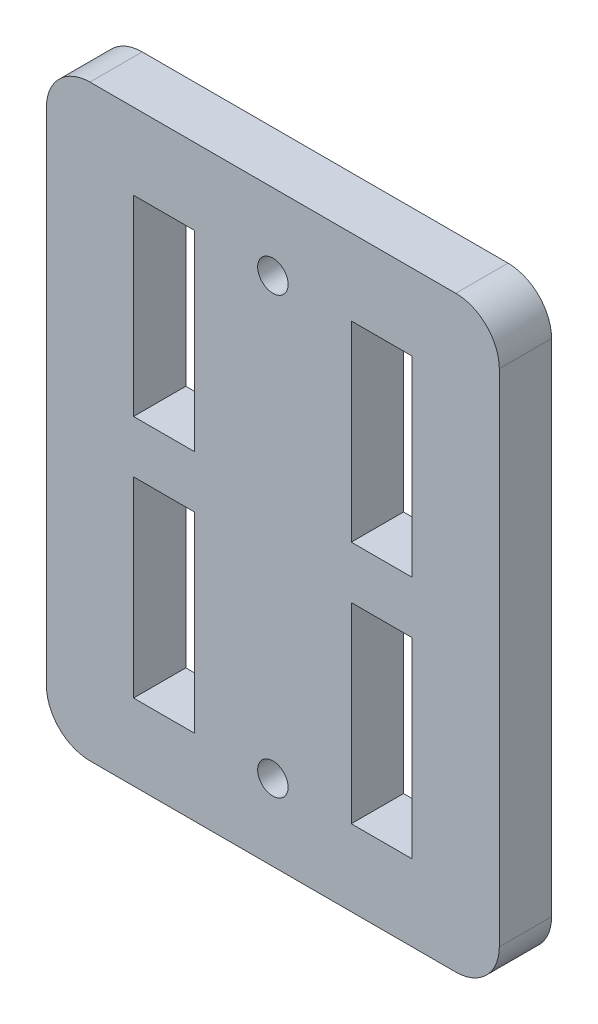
ISO-10303-21;
HEADER;
FILE_DESCRIPTION(('STEP AP214'),'2;1');
FILE_NAME('part.step','',(''),(''),'','','');
FILE_SCHEMA(('AUTOMOTIVE_DESIGN { 1 0 10303 214 1 1 1 1 }'));
ENDSEC;
DATA;
#1=APPLICATION_CONTEXT('core data for automotive mechanical design processes');
#2=APPLICATION_PROTOCOL_DEFINITION('international standard','automotive_design',2000,#1);
#3=PRODUCT_CONTEXT('',#1,'mechanical');
#4=PRODUCT('Part','Part','',(#3));
#5=PRODUCT_RELATED_PRODUCT_CATEGORY('part','',(#4));
#6=PRODUCT_DEFINITION_FORMATION('','',#4);
#7=PRODUCT_DEFINITION_CONTEXT('part definition',#1,'design');
#8=PRODUCT_DEFINITION('design','',#6,#7);
#9=PRODUCT_DEFINITION_SHAPE('','',#8);
#10=(LENGTH_UNIT() NAMED_UNIT(*) SI_UNIT(.MILLI.,.METRE.));
#11=(NAMED_UNIT(*) PLANE_ANGLE_UNIT() SI_UNIT($,.RADIAN.));
#12=(NAMED_UNIT(*) SI_UNIT($,.STERADIAN.) SOLID_ANGLE_UNIT());
#13=UNCERTAINTY_MEASURE_WITH_UNIT(LENGTH_MEASURE(1.E-05),#10,'distance_accuracy_value','');
#14=(GEOMETRIC_REPRESENTATION_CONTEXT(3) GLOBAL_UNCERTAINTY_ASSIGNED_CONTEXT((#13)) GLOBAL_UNIT_ASSIGNED_CONTEXT((#10,
#11,#12)) REPRESENTATION_CONTEXT('',''));
#15=CARTESIAN_POINT('',(0.,0.,0.));
#16=DIRECTION('',(0.,0.,1.));
#17=DIRECTION('',(1.,0.,0.));
#18=AXIS2_PLACEMENT_3D('',#15,#16,#17);
#19=CARTESIAN_POINT('',(21.,-28.75,3.));
#20=DIRECTION('',(0.,0.,-1.));
#21=DIRECTION('',(-1.,0.,0.));
#22=AXIS2_PLACEMENT_3D('',#19,#20,#21);
#23=CYLINDRICAL_SURFACE('',#22,5.);
#24=CARTESIAN_POINT('',(21.,-28.75,-3.));
#25=DIRECTION('',(0.,0.,-1.));
#26=DIRECTION('',(-1.,0.,0.));
#27=AXIS2_PLACEMENT_3D('',#24,#25,#26);
#28=CIRCLE('',#27,5.);
#29=CARTESIAN_POINT('',(26.,-28.75,-3.));
#30=VERTEX_POINT('',#29);
#31=CARTESIAN_POINT('',(21.,-33.75,-3.));
#32=VERTEX_POINT('',#31);
#33=EDGE_CURVE('E325',#30,#32,#28,.T.);
#34=ORIENTED_EDGE('',*,*,#33,.F.);
#35=DIRECTION('',(0.,0.,-1.));
#36=VECTOR('',#35,1.);
#37=CARTESIAN_POINT('',(26.,-28.75,3.));
#38=LINE('',#37,#36);
#39=CARTESIAN_POINT('',(26.,-28.75,3.));
#40=VERTEX_POINT('',#39);
#41=EDGE_CURVE('E11',#40,#30,#38,.T.);
#42=ORIENTED_EDGE('',*,*,#41,.F.);
#43=CARTESIAN_POINT('',(21.,-28.75,3.));
#44=DIRECTION('',(0.,0.,-1.));
#45=DIRECTION('',(-1.,0.,0.));
#46=AXIS2_PLACEMENT_3D('',#43,#44,#45);
#47=CIRCLE('',#46,5.);
#48=CARTESIAN_POINT('',(21.,-33.75,3.));
#49=VERTEX_POINT('',#48);
#50=EDGE_CURVE('E332',#40,#49,#47,.T.);
#51=ORIENTED_EDGE('',*,*,#50,.T.);
#52=DIRECTION('',(0.,0.,-1.));
#53=VECTOR('',#52,1.);
#54=CARTESIAN_POINT('',(21.,-33.75,3.));
#55=LINE('',#54,#53);
#56=EDGE_CURVE('E37',#49,#32,#55,.T.);
#57=ORIENTED_EDGE('',*,*,#56,.T.);
#58=EDGE_LOOP('',(#34,#42,#51,#57));
#59=FACE_BOUND('',#58,.T.);
#60=ADVANCED_FACE('F34',(#59),#23,.T.);
#61=CARTESIAN_POINT('',(26.,28.75,3.));
#62=DIRECTION('',(1.,0.,0.));
#63=DIRECTION('',(0.,0.,-1.));
#64=AXIS2_PLACEMENT_3D('',#61,#62,#63);
#65=PLANE('',#64);
#66=DIRECTION('',(0.,-1.,0.));
#67=VECTOR('',#66,1.);
#68=CARTESIAN_POINT('',(26.,28.75,-3.));
#69=LINE('',#68,#67);
#70=CARTESIAN_POINT('',(26.,28.75,-3.));
#71=VERTEX_POINT('',#70);
#72=EDGE_CURVE('E336',#71,#30,#69,.T.);
#73=ORIENTED_EDGE('',*,*,#72,.F.);
#74=DIRECTION('',(0.,0.,-1.));
#75=VECTOR('',#74,1.);
#76=CARTESIAN_POINT('',(26.,28.75,3.));
#77=LINE('',#76,#75);
#78=CARTESIAN_POINT('',(26.,28.75,3.));
#79=VERTEX_POINT('',#78);
#80=EDGE_CURVE('E42',#79,#71,#77,.T.);
#81=ORIENTED_EDGE('',*,*,#80,.F.);
#82=DIRECTION('',(0.,-1.,0.));
#83=VECTOR('',#82,1.);
#84=CARTESIAN_POINT('',(26.,28.75,3.));
#85=LINE('',#84,#83);
#86=EDGE_CURVE('E354',#79,#40,#85,.T.);
#87=ORIENTED_EDGE('',*,*,#86,.T.);
#88=ORIENTED_EDGE('',*,*,#41,.T.);
#89=EDGE_LOOP('',(#73,#81,#87,#88));
#90=FACE_BOUND('',#89,.T.);
#91=ADVANCED_FACE('F401',(#90),#65,.T.);
#92=CARTESIAN_POINT('',(21.,28.75,3.));
#93=DIRECTION('',(0.,0.,-1.));
#94=DIRECTION('',(-1.,0.,0.));
#95=AXIS2_PLACEMENT_3D('',#92,#93,#94);
#96=CYLINDRICAL_SURFACE('',#95,5.);
#97=CARTESIAN_POINT('',(21.,28.75,-3.));
#98=DIRECTION('',(0.,0.,-1.));
#99=DIRECTION('',(-1.,0.,0.));
#100=AXIS2_PLACEMENT_3D('',#97,#98,#99);
#101=CIRCLE('',#100,5.);
#102=CARTESIAN_POINT('',(21.,33.75,-3.));
#103=VERTEX_POINT('',#102);
#104=EDGE_CURVE('E374',#103,#71,#101,.T.);
#105=ORIENTED_EDGE('',*,*,#104,.F.);
#106=DIRECTION('',(0.,0.,-1.));
#107=VECTOR('',#106,1.);
#108=CARTESIAN_POINT('',(21.,33.75,3.));
#109=LINE('',#108,#107);
#110=CARTESIAN_POINT('',(21.,33.75,3.));
#111=VERTEX_POINT('',#110);
#112=EDGE_CURVE('E380',#111,#103,#109,.T.);
#113=ORIENTED_EDGE('',*,*,#112,.F.);
#114=CARTESIAN_POINT('',(21.,28.75,3.));
#115=DIRECTION('',(0.,0.,-1.));
#116=DIRECTION('',(-1.,0.,0.));
#117=AXIS2_PLACEMENT_3D('',#114,#115,#116);
#118=CIRCLE('',#117,5.);
#119=EDGE_CURVE('E351',#111,#79,#118,.T.);
#120=ORIENTED_EDGE('',*,*,#119,.T.);
#121=ORIENTED_EDGE('',*,*,#80,.T.);
#122=EDGE_LOOP('',(#105,#113,#120,#121));
#123=FACE_BOUND('',#122,.T.);
#124=ADVANCED_FACE('F421',(#123),#96,.T.);
#125=CARTESIAN_POINT('',(-21.,33.75,3.));
#126=DIRECTION('',(0.,1.,0.));
#127=DIRECTION('',(0.,0.,1.));
#128=AXIS2_PLACEMENT_3D('',#125,#126,#127);
#129=PLANE('',#128);
#130=DIRECTION('',(1.,0.,0.));
#131=VECTOR('',#130,1.);
#132=CARTESIAN_POINT('',(-21.,33.75,-3.));
#133=LINE('',#132,#131);
#134=CARTESIAN_POINT('',(-21.,33.75,-3.));
#135=VERTEX_POINT('',#134);
#136=EDGE_CURVE('E371',#135,#103,#133,.T.);
#137=ORIENTED_EDGE('',*,*,#136,.F.);
#138=DIRECTION('',(0.,0.,-1.));
#139=VECTOR('',#138,1.);
#140=CARTESIAN_POINT('',(-21.,33.75,3.));
#141=LINE('',#140,#139);
#142=CARTESIAN_POINT('',(-21.,33.75,3.));
#143=VERTEX_POINT('',#142);
#144=EDGE_CURVE('E382',#143,#135,#141,.T.);
#145=ORIENTED_EDGE('',*,*,#144,.F.);
#146=DIRECTION('',(1.,0.,0.));
#147=VECTOR('',#146,1.);
#148=CARTESIAN_POINT('',(-21.,33.75,3.));
#149=LINE('',#148,#147);
#150=EDGE_CURVE('E348',#143,#111,#149,.T.);
#151=ORIENTED_EDGE('',*,*,#150,.T.);
#152=ORIENTED_EDGE('',*,*,#112,.T.);
#153=EDGE_LOOP('',(#137,#145,#151,#152));
#154=FACE_BOUND('',#153,.T.);
#155=ADVANCED_FACE('F419',(#154),#129,.T.);
#156=CARTESIAN_POINT('',(-21.,28.75,3.));
#157=DIRECTION('',(0.,0.,-1.));
#158=DIRECTION('',(-1.,0.,0.));
#159=AXIS2_PLACEMENT_3D('',#156,#157,#158);
#160=CYLINDRICAL_SURFACE('',#159,5.);
#161=CARTESIAN_POINT('',(-21.,28.75,-3.));
#162=DIRECTION('',(0.,0.,-1.));
#163=DIRECTION('',(-1.,0.,0.));
#164=AXIS2_PLACEMENT_3D('',#161,#162,#163);
#165=CIRCLE('',#164,5.);
#166=CARTESIAN_POINT('',(-26.,28.75,-3.));
#167=VERTEX_POINT('',#166);
#168=EDGE_CURVE('E368',#167,#135,#165,.T.);
#169=ORIENTED_EDGE('',*,*,#168,.F.);
#170=DIRECTION('',(0.,0.,-1.));
#171=VECTOR('',#170,1.);
#172=CARTESIAN_POINT('',(-26.,28.75,3.));
#173=LINE('',#172,#171);
#174=CARTESIAN_POINT('',(-26.,28.75,3.));
#175=VERTEX_POINT('',#174);
#176=EDGE_CURVE('E384',#175,#167,#173,.T.);
#177=ORIENTED_EDGE('',*,*,#176,.F.);
#178=CARTESIAN_POINT('',(-21.,28.75,3.));
#179=DIRECTION('',(0.,0.,-1.));
#180=DIRECTION('',(-1.,0.,0.));
#181=AXIS2_PLACEMENT_3D('',#178,#179,#180);
#182=CIRCLE('',#181,5.);
#183=EDGE_CURVE('E345',#175,#143,#182,.T.);
#184=ORIENTED_EDGE('',*,*,#183,.T.);
#185=ORIENTED_EDGE('',*,*,#144,.T.);
#186=EDGE_LOOP('',(#169,#177,#184,#185));
#187=FACE_BOUND('',#186,.T.);
#188=ADVANCED_FACE('F415',(#187),#160,.T.);
#189=CARTESIAN_POINT('',(-26.,-28.75,3.));
#190=DIRECTION('',(-1.,0.,0.));
#191=DIRECTION('',(0.,0.,1.));
#192=AXIS2_PLACEMENT_3D('',#189,#190,#191);
#193=PLANE('',#192);
#194=DIRECTION('',(0.,1.,0.));
#195=VECTOR('',#194,1.);
#196=CARTESIAN_POINT('',(-26.,-28.75,-3.));
#197=LINE('',#196,#195);
#198=CARTESIAN_POINT('',(-26.,-28.75,-3.));
#199=VERTEX_POINT('',#198);
#200=EDGE_CURVE('E365',#199,#167,#197,.T.);
#201=ORIENTED_EDGE('',*,*,#200,.F.);
#202=DIRECTION('',(0.,0.,-1.));
#203=VECTOR('',#202,1.);
#204=CARTESIAN_POINT('',(-26.,-28.75,3.));
#205=LINE('',#204,#203);
#206=CARTESIAN_POINT('',(-26.,-28.75,3.));
#207=VERTEX_POINT('',#206);
#208=EDGE_CURVE('E386',#207,#199,#205,.T.);
#209=ORIENTED_EDGE('',*,*,#208,.F.);
#210=DIRECTION('',(0.,1.,0.));
#211=VECTOR('',#210,1.);
#212=CARTESIAN_POINT('',(-26.,-28.75,3.));
#213=LINE('',#212,#211);
#214=EDGE_CURVE('E342',#207,#175,#213,.T.);
#215=ORIENTED_EDGE('',*,*,#214,.T.);
#216=ORIENTED_EDGE('',*,*,#176,.T.);
#217=EDGE_LOOP('',(#201,#209,#215,#216));
#218=FACE_BOUND('',#217,.T.);
#219=ADVANCED_FACE('F413',(#218),#193,.T.);
#220=CARTESIAN_POINT('',(-21.,-28.75,3.));
#221=DIRECTION('',(0.,0.,-1.));
#222=DIRECTION('',(-1.,0.,0.));
#223=AXIS2_PLACEMENT_3D('',#220,#221,#222);
#224=CYLINDRICAL_SURFACE('',#223,5.);
#225=CARTESIAN_POINT('',(-21.,-28.75,-3.));
#226=DIRECTION('',(0.,0.,-1.));
#227=DIRECTION('',(-1.,0.,0.));
#228=AXIS2_PLACEMENT_3D('',#225,#226,#227);
#229=CIRCLE('',#228,5.);
#230=CARTESIAN_POINT('',(-21.,-33.75,-3.));
#231=VERTEX_POINT('',#230);
#232=EDGE_CURVE('E362',#231,#199,#229,.T.);
#233=ORIENTED_EDGE('',*,*,#232,.F.);
#234=DIRECTION('',(0.,0.,-1.));
#235=VECTOR('',#234,1.);
#236=CARTESIAN_POINT('',(-21.,-33.75,3.));
#237=LINE('',#236,#235);
#238=CARTESIAN_POINT('',(-21.,-33.75,3.));
#239=VERTEX_POINT('',#238);
#240=EDGE_CURVE('E387',#239,#231,#237,.T.);
#241=ORIENTED_EDGE('',*,*,#240,.F.);
#242=CARTESIAN_POINT('',(-21.,-28.75,3.));
#243=DIRECTION('',(0.,0.,-1.));
#244=DIRECTION('',(-1.,0.,0.));
#245=AXIS2_PLACEMENT_3D('',#242,#243,#244);
#246=CIRCLE('',#245,5.);
#247=EDGE_CURVE('E339',#239,#207,#246,.T.);
#248=ORIENTED_EDGE('',*,*,#247,.T.);
#249=ORIENTED_EDGE('',*,*,#208,.T.);
#250=EDGE_LOOP('',(#233,#241,#248,#249));
#251=FACE_BOUND('',#250,.T.);
#252=ADVANCED_FACE('F409',(#251),#224,.T.);
#253=CARTESIAN_POINT('',(21.,-33.75,3.));
#254=DIRECTION('',(0.,-1.,0.));
#255=DIRECTION('',(0.,0.,-1.));
#256=AXIS2_PLACEMENT_3D('',#253,#254,#255);
#257=PLANE('',#256);
#258=DIRECTION('',(-1.,0.,0.));
#259=VECTOR('',#258,1.);
#260=CARTESIAN_POINT('',(21.,-33.75,-3.));
#261=LINE('',#260,#259);
#262=EDGE_CURVE('E359',#32,#231,#261,.T.);
#263=ORIENTED_EDGE('',*,*,#262,.F.);
#264=ORIENTED_EDGE('',*,*,#56,.F.);
#265=DIRECTION('',(-1.,0.,0.));
#266=VECTOR('',#265,1.);
#267=CARTESIAN_POINT('',(21.,-33.75,3.));
#268=LINE('',#267,#266);
#269=EDGE_CURVE('E335',#49,#239,#268,.T.);
#270=ORIENTED_EDGE('',*,*,#269,.T.);
#271=ORIENTED_EDGE('',*,*,#240,.T.);
#272=EDGE_LOOP('',(#263,#264,#270,#271));
#273=FACE_BOUND('',#272,.T.);
#274=ADVANCED_FACE('F395',(#273),#257,.T.);
#275=CARTESIAN_POINT('',(21.,-28.75,3.));
#276=DIRECTION('',(0.,0.,-1.));
#277=DIRECTION('',(-1.,0.,0.));
#278=AXIS2_PLACEMENT_3D('',#275,#276,#277);
#279=PLANE('',#278);
#280=CARTESIAN_POINT('',(0.,-25.,3.));
#281=DIRECTION('',(0.,0.,-1.));
#282=DIRECTION('',(1.,0.,0.));
#283=AXIS2_PLACEMENT_3D('',#280,#281,#282);
#284=CIRCLE('',#283,1.75);
#285=CARTESIAN_POINT('',(1.75000000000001,-25.,3.));
#286=VERTEX_POINT('',#285);
#287=EDGE_CURVE('E678',#286,#286,#284,.T.);
#288=ORIENTED_EDGE('',*,*,#287,.T.);
#289=EDGE_LOOP('',(#288));
#290=FACE_BOUND('',#289,.T.);
#291=CARTESIAN_POINT('',(0.,25.,3.));
#292=DIRECTION('',(0.,0.,-1.));
#293=DIRECTION('',(1.,0.,0.));
#294=AXIS2_PLACEMENT_3D('',#291,#292,#293);
#295=CIRCLE('',#294,1.75);
#296=CARTESIAN_POINT('',(1.75000000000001,25.,3.));
#297=VERTEX_POINT('',#296);
#298=EDGE_CURVE('E226',#297,#297,#295,.T.);
#299=ORIENTED_EDGE('',*,*,#298,.T.);
#300=EDGE_LOOP('',(#299));
#301=FACE_BOUND('',#300,.T.);
#302=DIRECTION('',(1.,0.,0.));
#303=VECTOR('',#302,1.);
#304=CARTESIAN_POINT('',(-9.,-3.,3.));
#305=LINE('',#304,#303);
#306=CARTESIAN_POINT('',(-16.,-3.,3.));
#307=VERTEX_POINT('',#306);
#308=CARTESIAN_POINT('',(-9.,-3.,3.));
#309=VERTEX_POINT('',#308);
#310=EDGE_CURVE('E203',#307,#309,#305,.T.);
#311=ORIENTED_EDGE('',*,*,#310,.T.);
#312=DIRECTION('',(0.,-1.,0.));
#313=VECTOR('',#312,1.);
#314=CARTESIAN_POINT('',(-9.,-25.,3.));
#315=LINE('',#314,#313);
#316=CARTESIAN_POINT('',(-9.,-25.,3.));
#317=VERTEX_POINT('',#316);
#318=EDGE_CURVE('E197',#309,#317,#315,.T.);
#319=ORIENTED_EDGE('',*,*,#318,.T.);
#320=DIRECTION('',(-1.,0.,0.));
#321=VECTOR('',#320,1.);
#322=CARTESIAN_POINT('',(-16.,-25.,3.));
#323=LINE('',#322,#321);
#324=CARTESIAN_POINT('',(-16.,-25.,3.));
#325=VERTEX_POINT('',#324);
#326=EDGE_CURVE('E206',#317,#325,#323,.T.);
#327=ORIENTED_EDGE('',*,*,#326,.T.);
#328=DIRECTION('',(0.,1.,0.));
#329=VECTOR('',#328,1.);
#330=CARTESIAN_POINT('',(-16.,-3.,3.));
#331=LINE('',#330,#329);
#332=EDGE_CURVE('E50',#325,#307,#331,.T.);
#333=ORIENTED_EDGE('',*,*,#332,.T.);
#334=EDGE_LOOP('',(#311,#319,#327,#333));
#335=FACE_BOUND('',#334,.T.);
#336=DIRECTION('',(0.,1.,0.));
#337=VECTOR('',#336,1.);
#338=CARTESIAN_POINT('',(9.,-3.,3.));
#339=LINE('',#338,#337);
#340=CARTESIAN_POINT('',(9.,-25.,3.));
#341=VERTEX_POINT('',#340);
#342=CARTESIAN_POINT('',(9.,-3.,3.));
#343=VERTEX_POINT('',#342);
#344=EDGE_CURVE('E246',#341,#343,#339,.T.);
#345=ORIENTED_EDGE('',*,*,#344,.T.);
#346=DIRECTION('',(1.,0.,0.));
#347=VECTOR('',#346,1.);
#348=CARTESIAN_POINT('',(16.,-3.,3.));
#349=LINE('',#348,#347);
#350=CARTESIAN_POINT('',(16.,-3.,3.));
#351=VERTEX_POINT('',#350);
#352=EDGE_CURVE('E236',#343,#351,#349,.T.);
#353=ORIENTED_EDGE('',*,*,#352,.T.);
#354=DIRECTION('',(0.,-1.,0.));
#355=VECTOR('',#354,1.);
#356=CARTESIAN_POINT('',(16.,-25.,3.));
#357=LINE('',#356,#355);
#358=CARTESIAN_POINT('',(16.,-25.,3.));
#359=VERTEX_POINT('',#358);
#360=EDGE_CURVE('E239',#351,#359,#357,.T.);
#361=ORIENTED_EDGE('',*,*,#360,.T.);
#362=DIRECTION('',(-1.,0.,0.));
#363=VECTOR('',#362,1.);
#364=CARTESIAN_POINT('',(9.,-25.,3.));
#365=LINE('',#364,#363);
#366=EDGE_CURVE('E243',#359,#341,#365,.T.);
#367=ORIENTED_EDGE('',*,*,#366,.T.);
#368=EDGE_LOOP('',(#345,#353,#361,#367));
#369=FACE_BOUND('',#368,.T.);
#370=DIRECTION('',(-1.,0.,0.));
#371=VECTOR('',#370,1.);
#372=CARTESIAN_POINT('',(9.,3.,3.));
#373=LINE('',#372,#371);
#374=CARTESIAN_POINT('',(16.,3.,3.));
#375=VERTEX_POINT('',#374);
#376=CARTESIAN_POINT('',(9.,3.,3.));
#377=VERTEX_POINT('',#376);
#378=EDGE_CURVE('E278',#375,#377,#373,.T.);
#379=ORIENTED_EDGE('',*,*,#378,.T.);
#380=DIRECTION('',(0.,1.,0.));
#381=VECTOR('',#380,1.);
#382=CARTESIAN_POINT('',(9.,25.,3.));
#383=LINE('',#382,#381);
#384=CARTESIAN_POINT('',(9.,25.,3.));
#385=VERTEX_POINT('',#384);
#386=EDGE_CURVE('E268',#377,#385,#383,.T.);
#387=ORIENTED_EDGE('',*,*,#386,.T.);
#388=DIRECTION('',(1.,0.,0.));
#389=VECTOR('',#388,1.);
#390=CARTESIAN_POINT('',(16.,25.,3.));
#391=LINE('',#390,#389);
#392=CARTESIAN_POINT('',(16.,25.,3.));
#393=VERTEX_POINT('',#392);
#394=EDGE_CURVE('E271',#385,#393,#391,.T.);
#395=ORIENTED_EDGE('',*,*,#394,.T.);
#396=DIRECTION('',(0.,-1.,0.));
#397=VECTOR('',#396,1.);
#398=CARTESIAN_POINT('',(16.,3.,3.));
#399=LINE('',#398,#397);
#400=EDGE_CURVE('E275',#393,#375,#399,.T.);
#401=ORIENTED_EDGE('',*,*,#400,.T.);
#402=EDGE_LOOP('',(#379,#387,#395,#401));
#403=FACE_BOUND('',#402,.T.);
#404=DIRECTION('',(0.,-1.,0.));
#405=VECTOR('',#404,1.);
#406=CARTESIAN_POINT('',(-9.,3.,3.));
#407=LINE('',#406,#405);
#408=CARTESIAN_POINT('',(-9.,25.,3.));
#409=VERTEX_POINT('',#408);
#410=CARTESIAN_POINT('',(-9.,3.,3.));
#411=VERTEX_POINT('',#410);
#412=EDGE_CURVE('E310',#409,#411,#407,.T.);
#413=ORIENTED_EDGE('',*,*,#412,.T.);
#414=DIRECTION('',(-1.,0.,0.));
#415=VECTOR('',#414,1.);
#416=CARTESIAN_POINT('',(-16.,3.,3.));
#417=LINE('',#416,#415);
#418=CARTESIAN_POINT('',(-16.,3.,3.));
#419=VERTEX_POINT('',#418);
#420=EDGE_CURVE('E300',#411,#419,#417,.T.);
#421=ORIENTED_EDGE('',*,*,#420,.T.);
#422=DIRECTION('',(0.,1.,0.));
#423=VECTOR('',#422,1.);
#424=CARTESIAN_POINT('',(-16.,25.,3.));
#425=LINE('',#424,#423);
#426=CARTESIAN_POINT('',(-16.,25.,3.));
#427=VERTEX_POINT('',#426);
#428=EDGE_CURVE('E303',#419,#427,#425,.T.);
#429=ORIENTED_EDGE('',*,*,#428,.T.);
#430=DIRECTION('',(1.,0.,0.));
#431=VECTOR('',#430,1.);
#432=CARTESIAN_POINT('',(-9.,25.,3.));
#433=LINE('',#432,#431);
#434=EDGE_CURVE('E307',#427,#409,#433,.T.);
#435=ORIENTED_EDGE('',*,*,#434,.T.);
#436=EDGE_LOOP('',(#413,#421,#429,#435));
#437=FACE_BOUND('',#436,.T.);
#438=ORIENTED_EDGE('',*,*,#50,.F.);
#439=ORIENTED_EDGE('',*,*,#86,.F.);
#440=ORIENTED_EDGE('',*,*,#119,.F.);
#441=ORIENTED_EDGE('',*,*,#150,.F.);
#442=ORIENTED_EDGE('',*,*,#183,.F.);
#443=ORIENTED_EDGE('',*,*,#214,.F.);
#444=ORIENTED_EDGE('',*,*,#247,.F.);
#445=ORIENTED_EDGE('',*,*,#269,.F.);
#446=EDGE_LOOP('',(#438,#439,#440,#441,#442,#443,#444,#445));
#447=FACE_BOUND('',#446,.T.);
#448=ADVANCED_FACE('F210',(#290,#301,#335,#369,#403,#437,#447),#279,.F.);
#449=CARTESIAN_POINT('',(21.,-28.75,-3.));
#450=DIRECTION('',(0.,0.,-1.));
#451=DIRECTION('',(-1.,0.,0.));
#452=AXIS2_PLACEMENT_3D('',#449,#450,#451);
#453=PLANE('',#452);
#454=CARTESIAN_POINT('',(0.,-25.,-3.));
#455=DIRECTION('',(0.,0.,-1.));
#456=DIRECTION('',(1.,0.,0.));
#457=AXIS2_PLACEMENT_3D('',#454,#455,#456);
#458=CIRCLE('',#457,1.75);
#459=CARTESIAN_POINT('',(1.75000000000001,-25.,-3.));
#460=VERTEX_POINT('',#459);
#461=EDGE_CURVE('E681',#460,#460,#458,.T.);
#462=ORIENTED_EDGE('',*,*,#461,.F.);
#463=EDGE_LOOP('',(#462));
#464=FACE_BOUND('',#463,.T.);
#465=CARTESIAN_POINT('',(0.,25.,-3.));
#466=DIRECTION('',(0.,0.,-1.));
#467=DIRECTION('',(1.,0.,0.));
#468=AXIS2_PLACEMENT_3D('',#465,#466,#467);
#469=CIRCLE('',#468,1.75);
#470=CARTESIAN_POINT('',(1.75000000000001,25.,-3.));
#471=VERTEX_POINT('',#470);
#472=EDGE_CURVE('E219',#471,#471,#469,.T.);
#473=ORIENTED_EDGE('',*,*,#472,.F.);
#474=EDGE_LOOP('',(#473));
#475=FACE_BOUND('',#474,.T.);
#476=DIRECTION('',(0.,-1.,0.));
#477=VECTOR('',#476,1.);
#478=CARTESIAN_POINT('',(-9.,-25.,-3.));
#479=LINE('',#478,#477);
#480=CARTESIAN_POINT('',(-9.,-3.,-3.));
#481=VERTEX_POINT('',#480);
#482=CARTESIAN_POINT('',(-9.00000000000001,-25.,-3.));
#483=VERTEX_POINT('',#482);
#484=EDGE_CURVE('E58',#481,#483,#479,.T.);
#485=ORIENTED_EDGE('',*,*,#484,.F.);
#486=DIRECTION('',(1.,0.,0.));
#487=VECTOR('',#486,1.);
#488=CARTESIAN_POINT('',(-9.,-3.,-3.));
#489=LINE('',#488,#487);
#490=CARTESIAN_POINT('',(-16.,-3.,-3.));
#491=VERTEX_POINT('',#490);
#492=EDGE_CURVE('E213',#491,#481,#489,.T.);
#493=ORIENTED_EDGE('',*,*,#492,.F.);
#494=DIRECTION('',(0.,1.,0.));
#495=VECTOR('',#494,1.);
#496=CARTESIAN_POINT('',(-16.,-3.,-3.));
#497=LINE('',#496,#495);
#498=CARTESIAN_POINT('',(-16.,-25.,-3.));
#499=VERTEX_POINT('',#498);
#500=EDGE_CURVE('E216',#499,#491,#497,.T.);
#501=ORIENTED_EDGE('',*,*,#500,.F.);
#502=DIRECTION('',(-1.,0.,0.));
#503=VECTOR('',#502,1.);
#504=CARTESIAN_POINT('',(-16.,-25.,-3.));
#505=LINE('',#504,#503);
#506=EDGE_CURVE('E225',#483,#499,#505,.T.);
#507=ORIENTED_EDGE('',*,*,#506,.F.);
#508=EDGE_LOOP('',(#485,#493,#501,#507));
#509=FACE_BOUND('',#508,.T.);
#510=DIRECTION('',(1.,0.,0.));
#511=VECTOR('',#510,1.);
#512=CARTESIAN_POINT('',(16.,-3.,-3.));
#513=LINE('',#512,#511);
#514=CARTESIAN_POINT('',(9.,-3.,-3.));
#515=VERTEX_POINT('',#514);
#516=CARTESIAN_POINT('',(16.,-3.,-3.));
#517=VERTEX_POINT('',#516);
#518=EDGE_CURVE('E232',#515,#517,#513,.T.);
#519=ORIENTED_EDGE('',*,*,#518,.F.);
#520=DIRECTION('',(0.,1.,0.));
#521=VECTOR('',#520,1.);
#522=CARTESIAN_POINT('',(9.,-3.,-3.));
#523=LINE('',#522,#521);
#524=CARTESIAN_POINT('',(9.,-25.,-3.));
#525=VERTEX_POINT('',#524);
#526=EDGE_CURVE('E240',#525,#515,#523,.T.);
#527=ORIENTED_EDGE('',*,*,#526,.F.);
#528=DIRECTION('',(-1.,0.,0.));
#529=VECTOR('',#528,1.);
#530=CARTESIAN_POINT('',(9.,-25.,-3.));
#531=LINE('',#530,#529);
#532=CARTESIAN_POINT('',(16.,-25.,-3.));
#533=VERTEX_POINT('',#532);
#534=EDGE_CURVE('E254',#533,#525,#531,.T.);
#535=ORIENTED_EDGE('',*,*,#534,.F.);
#536=DIRECTION('',(0.,-1.,0.));
#537=VECTOR('',#536,1.);
#538=CARTESIAN_POINT('',(16.,-25.,-3.));
#539=LINE('',#538,#537);
#540=EDGE_CURVE('E251',#517,#533,#539,.T.);
#541=ORIENTED_EDGE('',*,*,#540,.F.);
#542=EDGE_LOOP('',(#519,#527,#535,#541));
#543=FACE_BOUND('',#542,.T.);
#544=DIRECTION('',(0.,1.,0.));
#545=VECTOR('',#544,1.);
#546=CARTESIAN_POINT('',(9.,25.,-3.));
#547=LINE('',#546,#545);
#548=CARTESIAN_POINT('',(9.,3.,-3.));
#549=VERTEX_POINT('',#548);
#550=CARTESIAN_POINT('',(9.,25.,-3.));
#551=VERTEX_POINT('',#550);
#552=EDGE_CURVE('E261',#549,#551,#547,.T.);
#553=ORIENTED_EDGE('',*,*,#552,.F.);
#554=DIRECTION('',(-1.,0.,0.));
#555=VECTOR('',#554,1.);
#556=CARTESIAN_POINT('',(9.,3.,-3.));
#557=LINE('',#556,#555);
#558=CARTESIAN_POINT('',(16.,3.,-3.));
#559=VERTEX_POINT('',#558);
#560=EDGE_CURVE('E272',#559,#549,#557,.T.);
#561=ORIENTED_EDGE('',*,*,#560,.F.);
#562=DIRECTION('',(0.,-1.,0.));
#563=VECTOR('',#562,1.);
#564=CARTESIAN_POINT('',(16.,3.,-3.));
#565=LINE('',#564,#563);
#566=CARTESIAN_POINT('',(16.,25.,-3.));
#567=VERTEX_POINT('',#566);
#568=EDGE_CURVE('E286',#567,#559,#565,.T.);
#569=ORIENTED_EDGE('',*,*,#568,.F.);
#570=DIRECTION('',(1.,0.,0.));
#571=VECTOR('',#570,1.);
#572=CARTESIAN_POINT('',(16.,25.,-3.));
#573=LINE('',#572,#571);
#574=EDGE_CURVE('E283',#551,#567,#573,.T.);
#575=ORIENTED_EDGE('',*,*,#574,.F.);
#576=EDGE_LOOP('',(#553,#561,#569,#575));
#577=FACE_BOUND('',#576,.T.);
#578=DIRECTION('',(-1.,0.,0.));
#579=VECTOR('',#578,1.);
#580=CARTESIAN_POINT('',(-16.,3.,-3.));
#581=LINE('',#580,#579);
#582=CARTESIAN_POINT('',(-9.,3.,-3.));
#583=VERTEX_POINT('',#582);
#584=CARTESIAN_POINT('',(-16.,3.,-3.));
#585=VERTEX_POINT('',#584);
#586=EDGE_CURVE('E293',#583,#585,#581,.T.);
#587=ORIENTED_EDGE('',*,*,#586,.F.);
#588=DIRECTION('',(0.,-1.,0.));
#589=VECTOR('',#588,1.);
#590=CARTESIAN_POINT('',(-9.,3.,-3.));
#591=LINE('',#590,#589);
#592=CARTESIAN_POINT('',(-9.,25.,-3.));
#593=VERTEX_POINT('',#592);
#594=EDGE_CURVE('E304',#593,#583,#591,.T.);
#595=ORIENTED_EDGE('',*,*,#594,.F.);
#596=DIRECTION('',(1.,0.,0.));
#597=VECTOR('',#596,1.);
#598=CARTESIAN_POINT('',(-9.,25.,-3.));
#599=LINE('',#598,#597);
#600=CARTESIAN_POINT('',(-16.,25.,-3.));
#601=VERTEX_POINT('',#600);
#602=EDGE_CURVE('E318',#601,#593,#599,.T.);
#603=ORIENTED_EDGE('',*,*,#602,.F.);
#604=DIRECTION('',(0.,1.,0.));
#605=VECTOR('',#604,1.);
#606=CARTESIAN_POINT('',(-16.,25.,-3.));
#607=LINE('',#606,#605);
#608=EDGE_CURVE('E315',#585,#601,#607,.T.);
#609=ORIENTED_EDGE('',*,*,#608,.F.);
#610=EDGE_LOOP('',(#587,#595,#603,#609));
#611=FACE_BOUND('',#610,.T.);
#612=ORIENTED_EDGE('',*,*,#33,.T.);
#613=ORIENTED_EDGE('',*,*,#262,.T.);
#614=ORIENTED_EDGE('',*,*,#232,.T.);
#615=ORIENTED_EDGE('',*,*,#200,.T.);
#616=ORIENTED_EDGE('',*,*,#168,.T.);
#617=ORIENTED_EDGE('',*,*,#136,.T.);
#618=ORIENTED_EDGE('',*,*,#104,.T.);
#619=ORIENTED_EDGE('',*,*,#72,.T.);
#620=EDGE_LOOP('',(#612,#613,#614,#615,#616,#617,#618,#619));
#621=FACE_BOUND('',#620,.T.);
#622=ADVANCED_FACE('F397',(#464,#475,#509,#543,#577,#611,#621),#453,.T.);
#623=CARTESIAN_POINT('',(-16.,3.,3.));
#624=DIRECTION('',(0.,-1.,0.));
#625=DIRECTION('',(0.,0.,-1.));
#626=AXIS2_PLACEMENT_3D('',#623,#624,#625);
#627=PLANE('',#626);
#628=ORIENTED_EDGE('',*,*,#586,.T.);
#629=DIRECTION('',(0.,0.,-1.));
#630=VECTOR('',#629,1.);
#631=CARTESIAN_POINT('',(-16.,3.,3.));
#632=LINE('',#631,#630);
#633=EDGE_CURVE('E313',#419,#585,#632,.T.);
#634=ORIENTED_EDGE('',*,*,#633,.F.);
#635=ORIENTED_EDGE('',*,*,#420,.F.);
#636=DIRECTION('',(0.,0.,-1.));
#637=VECTOR('',#636,1.);
#638=CARTESIAN_POINT('',(-9.,3.,3.));
#639=LINE('',#638,#637);
#640=EDGE_CURVE('E323',#411,#583,#639,.T.);
#641=ORIENTED_EDGE('',*,*,#640,.T.);
#642=EDGE_LOOP('',(#628,#634,#635,#641));
#643=FACE_BOUND('',#642,.T.);
#644=ADVANCED_FACE('F496',(#643),#627,.F.);
#645=CARTESIAN_POINT('',(-9.,3.,3.));
#646=DIRECTION('',(1.,0.,0.));
#647=DIRECTION('',(0.,0.,-1.));
#648=AXIS2_PLACEMENT_3D('',#645,#646,#647);
#649=PLANE('',#648);
#650=ORIENTED_EDGE('',*,*,#594,.T.);
#651=ORIENTED_EDGE('',*,*,#640,.F.);
#652=ORIENTED_EDGE('',*,*,#412,.F.);
#653=DIRECTION('',(0.,0.,-1.));
#654=VECTOR('',#653,1.);
#655=CARTESIAN_POINT('',(-9.,25.,3.));
#656=LINE('',#655,#654);
#657=EDGE_CURVE('E326',#409,#593,#656,.T.);
#658=ORIENTED_EDGE('',*,*,#657,.T.);
#659=EDGE_LOOP('',(#650,#651,#652,#658));
#660=FACE_BOUND('',#659,.T.);
#661=ADVANCED_FACE('F506',(#660),#649,.F.);
#662=CARTESIAN_POINT('',(-9.,25.,3.));
#663=DIRECTION('',(0.,1.,0.));
#664=DIRECTION('',(0.,0.,1.));
#665=AXIS2_PLACEMENT_3D('',#662,#663,#664);
#666=PLANE('',#665);
#667=ORIENTED_EDGE('',*,*,#602,.T.);
#668=ORIENTED_EDGE('',*,*,#657,.F.);
#669=ORIENTED_EDGE('',*,*,#434,.F.);
#670=DIRECTION('',(0.,0.,-1.));
#671=VECTOR('',#670,1.);
#672=CARTESIAN_POINT('',(-16.,25.,3.));
#673=LINE('',#672,#671);
#674=EDGE_CURVE('E328',#427,#601,#673,.T.);
#675=ORIENTED_EDGE('',*,*,#674,.T.);
#676=EDGE_LOOP('',(#667,#668,#669,#675));
#677=FACE_BOUND('',#676,.T.);
#678=ADVANCED_FACE('F516',(#677),#666,.F.);
#679=CARTESIAN_POINT('',(-16.,25.,3.));
#680=DIRECTION('',(-1.,0.,0.));
#681=DIRECTION('',(0.,0.,1.));
#682=AXIS2_PLACEMENT_3D('',#679,#680,#681);
#683=PLANE('',#682);
#684=ORIENTED_EDGE('',*,*,#608,.T.);
#685=ORIENTED_EDGE('',*,*,#674,.F.);
#686=ORIENTED_EDGE('',*,*,#428,.F.);
#687=ORIENTED_EDGE('',*,*,#633,.T.);
#688=EDGE_LOOP('',(#684,#685,#686,#687));
#689=FACE_BOUND('',#688,.T.);
#690=ADVANCED_FACE('F526',(#689),#683,.F.);
#691=CARTESIAN_POINT('',(9.,25.,3.));
#692=DIRECTION('',(-1.,0.,0.));
#693=DIRECTION('',(0.,0.,1.));
#694=AXIS2_PLACEMENT_3D('',#691,#692,#693);
#695=PLANE('',#694);
#696=ORIENTED_EDGE('',*,*,#552,.T.);
#697=DIRECTION('',(0.,0.,-1.));
#698=VECTOR('',#697,1.);
#699=CARTESIAN_POINT('',(9.,25.,3.));
#700=LINE('',#699,#698);
#701=EDGE_CURVE('E281',#385,#551,#700,.T.);
#702=ORIENTED_EDGE('',*,*,#701,.F.);
#703=ORIENTED_EDGE('',*,*,#386,.F.);
#704=DIRECTION('',(0.,0.,-1.));
#705=VECTOR('',#704,1.);
#706=CARTESIAN_POINT('',(9.,3.,3.));
#707=LINE('',#706,#705);
#708=EDGE_CURVE('E291',#377,#549,#707,.T.);
#709=ORIENTED_EDGE('',*,*,#708,.T.);
#710=EDGE_LOOP('',(#696,#702,#703,#709));
#711=FACE_BOUND('',#710,.T.);
#712=ADVANCED_FACE('F536',(#711),#695,.F.);
#713=CARTESIAN_POINT('',(9.,3.,3.));
#714=DIRECTION('',(0.,-1.,0.));
#715=DIRECTION('',(1.,0.,0.));
#716=AXIS2_PLACEMENT_3D('',#713,#714,#715);
#717=PLANE('',#716);
#718=ORIENTED_EDGE('',*,*,#560,.T.);
#719=ORIENTED_EDGE('',*,*,#708,.F.);
#720=ORIENTED_EDGE('',*,*,#378,.F.);
#721=DIRECTION('',(0.,0.,-1.));
#722=VECTOR('',#721,1.);
#723=CARTESIAN_POINT('',(16.,3.,3.));
#724=LINE('',#723,#722);
#725=EDGE_CURVE('E294',#375,#559,#724,.T.);
#726=ORIENTED_EDGE('',*,*,#725,.T.);
#727=EDGE_LOOP('',(#718,#719,#720,#726));
#728=FACE_BOUND('',#727,.T.);
#729=ADVANCED_FACE('F546',(#728),#717,.F.);
#730=CARTESIAN_POINT('',(16.,3.,3.));
#731=DIRECTION('',(1.,0.,0.));
#732=DIRECTION('',(0.,0.,-1.));
#733=AXIS2_PLACEMENT_3D('',#730,#731,#732);
#734=PLANE('',#733);
#735=ORIENTED_EDGE('',*,*,#568,.T.);
#736=ORIENTED_EDGE('',*,*,#725,.F.);
#737=ORIENTED_EDGE('',*,*,#400,.F.);
#738=DIRECTION('',(0.,0.,-1.));
#739=VECTOR('',#738,1.);
#740=CARTESIAN_POINT('',(16.,25.,3.));
#741=LINE('',#740,#739);
#742=EDGE_CURVE('E296',#393,#567,#741,.T.);
#743=ORIENTED_EDGE('',*,*,#742,.T.);
#744=EDGE_LOOP('',(#735,#736,#737,#743));
#745=FACE_BOUND('',#744,.T.);
#746=ADVANCED_FACE('F556',(#745),#734,.F.);
#747=CARTESIAN_POINT('',(16.,25.,3.));
#748=DIRECTION('',(0.,1.,0.));
#749=DIRECTION('',(0.,0.,1.));
#750=AXIS2_PLACEMENT_3D('',#747,#748,#749);
#751=PLANE('',#750);
#752=ORIENTED_EDGE('',*,*,#574,.T.);
#753=ORIENTED_EDGE('',*,*,#742,.F.);
#754=ORIENTED_EDGE('',*,*,#394,.F.);
#755=ORIENTED_EDGE('',*,*,#701,.T.);
#756=EDGE_LOOP('',(#752,#753,#754,#755));
#757=FACE_BOUND('',#756,.T.);
#758=ADVANCED_FACE('F566',(#757),#751,.F.);
#759=CARTESIAN_POINT('',(16.,-3.,3.));
#760=DIRECTION('',(0.,1.,0.));
#761=DIRECTION('',(0.,0.,1.));
#762=AXIS2_PLACEMENT_3D('',#759,#760,#761);
#763=PLANE('',#762);
#764=ORIENTED_EDGE('',*,*,#518,.T.);
#765=DIRECTION('',(0.,0.,-1.));
#766=VECTOR('',#765,1.);
#767=CARTESIAN_POINT('',(16.,-3.,3.));
#768=LINE('',#767,#766);
#769=EDGE_CURVE('E249',#351,#517,#768,.T.);
#770=ORIENTED_EDGE('',*,*,#769,.F.);
#771=ORIENTED_EDGE('',*,*,#352,.F.);
#772=DIRECTION('',(0.,0.,-1.));
#773=VECTOR('',#772,1.);
#774=CARTESIAN_POINT('',(9.,-3.,3.));
#775=LINE('',#774,#773);
#776=EDGE_CURVE('E259',#343,#515,#775,.T.);
#777=ORIENTED_EDGE('',*,*,#776,.T.);
#778=EDGE_LOOP('',(#764,#770,#771,#777));
#779=FACE_BOUND('',#778,.T.);
#780=ADVANCED_FACE('F576',(#779),#763,.F.);
#781=CARTESIAN_POINT('',(9.,-3.,3.));
#782=DIRECTION('',(-1.,0.,0.));
#783=DIRECTION('',(0.,0.,1.));
#784=AXIS2_PLACEMENT_3D('',#781,#782,#783);
#785=PLANE('',#784);
#786=ORIENTED_EDGE('',*,*,#526,.T.);
#787=ORIENTED_EDGE('',*,*,#776,.F.);
#788=ORIENTED_EDGE('',*,*,#344,.F.);
#789=DIRECTION('',(0.,0.,-1.));
#790=VECTOR('',#789,1.);
#791=CARTESIAN_POINT('',(9.,-25.,3.));
#792=LINE('',#791,#790);
#793=EDGE_CURVE('E262',#341,#525,#792,.T.);
#794=ORIENTED_EDGE('',*,*,#793,.T.);
#795=EDGE_LOOP('',(#786,#787,#788,#794));
#796=FACE_BOUND('',#795,.T.);
#797=ADVANCED_FACE('F586',(#796),#785,.F.);
#798=CARTESIAN_POINT('',(9.,-25.,3.));
#799=DIRECTION('',(0.,-1.,0.));
#800=DIRECTION('',(0.,0.,-1.));
#801=AXIS2_PLACEMENT_3D('',#798,#799,#800);
#802=PLANE('',#801);
#803=ORIENTED_EDGE('',*,*,#534,.T.);
#804=ORIENTED_EDGE('',*,*,#793,.F.);
#805=ORIENTED_EDGE('',*,*,#366,.F.);
#806=DIRECTION('',(0.,0.,-1.));
#807=VECTOR('',#806,1.);
#808=CARTESIAN_POINT('',(16.,-25.,3.));
#809=LINE('',#808,#807);
#810=EDGE_CURVE('E264',#359,#533,#809,.T.);
#811=ORIENTED_EDGE('',*,*,#810,.T.);
#812=EDGE_LOOP('',(#803,#804,#805,#811));
#813=FACE_BOUND('',#812,.T.);
#814=ADVANCED_FACE('F596',(#813),#802,.F.);
#815=CARTESIAN_POINT('',(16.,-25.,3.));
#816=DIRECTION('',(1.,0.,0.));
#817=DIRECTION('',(0.,0.,-1.));
#818=AXIS2_PLACEMENT_3D('',#815,#816,#817);
#819=PLANE('',#818);
#820=ORIENTED_EDGE('',*,*,#540,.T.);
#821=ORIENTED_EDGE('',*,*,#810,.F.);
#822=ORIENTED_EDGE('',*,*,#360,.F.);
#823=ORIENTED_EDGE('',*,*,#769,.T.);
#824=EDGE_LOOP('',(#820,#821,#822,#823));
#825=FACE_BOUND('',#824,.T.);
#826=ADVANCED_FACE('F606',(#825),#819,.F.);
#827=CARTESIAN_POINT('',(-9.,-25.,3.));
#828=DIRECTION('',(1.,0.,0.));
#829=DIRECTION('',(0.,0.,-1.));
#830=AXIS2_PLACEMENT_3D('',#827,#828,#829);
#831=PLANE('',#830);
#832=ORIENTED_EDGE('',*,*,#484,.T.);
#833=DIRECTION('',(0.,0.,-1.));
#834=VECTOR('',#833,1.);
#835=CARTESIAN_POINT('',(-9.,-25.,3.));
#836=LINE('',#835,#834);
#837=EDGE_CURVE('E193',#317,#483,#836,.T.);
#838=ORIENTED_EDGE('',*,*,#837,.F.);
#839=ORIENTED_EDGE('',*,*,#318,.F.);
#840=DIRECTION('',(0.,0.,-1.));
#841=VECTOR('',#840,1.);
#842=CARTESIAN_POINT('',(-9.,-3.,3.));
#843=LINE('',#842,#841);
#844=EDGE_CURVE('E230',#309,#481,#843,.T.);
#845=ORIENTED_EDGE('',*,*,#844,.T.);
#846=EDGE_LOOP('',(#832,#838,#839,#845));
#847=FACE_BOUND('',#846,.T.);
#848=ADVANCED_FACE('F195',(#847),#831,.F.);
#849=CARTESIAN_POINT('',(-9.,-3.,3.));
#850=DIRECTION('',(0.,1.,0.));
#851=DIRECTION('',(0.,0.,1.));
#852=AXIS2_PLACEMENT_3D('',#849,#850,#851);
#853=PLANE('',#852);
#854=ORIENTED_EDGE('',*,*,#492,.T.);
#855=ORIENTED_EDGE('',*,*,#844,.F.);
#856=ORIENTED_EDGE('',*,*,#310,.F.);
#857=DIRECTION('',(0.,0.,-1.));
#858=VECTOR('',#857,1.);
#859=CARTESIAN_POINT('',(-16.,-3.,3.));
#860=LINE('',#859,#858);
#861=EDGE_CURVE('E233',#307,#491,#860,.T.);
#862=ORIENTED_EDGE('',*,*,#861,.T.);
#863=EDGE_LOOP('',(#854,#855,#856,#862));
#864=FACE_BOUND('',#863,.T.);
#865=ADVANCED_FACE('F625',(#864),#853,.F.);
#866=CARTESIAN_POINT('',(-16.,-3.,3.));
#867=DIRECTION('',(-1.,0.,0.));
#868=DIRECTION('',(0.,0.,1.));
#869=AXIS2_PLACEMENT_3D('',#866,#867,#868);
#870=PLANE('',#869);
#871=ORIENTED_EDGE('',*,*,#500,.T.);
#872=ORIENTED_EDGE('',*,*,#861,.F.);
#873=ORIENTED_EDGE('',*,*,#332,.F.);
#874=DIRECTION('',(0.,0.,-1.));
#875=VECTOR('',#874,1.);
#876=CARTESIAN_POINT('',(-16.,-25.,3.));
#877=LINE('',#876,#875);
#878=EDGE_CURVE('E202',#325,#499,#877,.T.);
#879=ORIENTED_EDGE('',*,*,#878,.T.);
#880=EDGE_LOOP('',(#871,#872,#873,#879));
#881=FACE_BOUND('',#880,.T.);
#882=ADVANCED_FACE('F634',(#881),#870,.F.);
#883=CARTESIAN_POINT('',(-16.,-25.,3.));
#884=DIRECTION('',(0.,-1.,0.));
#885=DIRECTION('',(0.,0.,-1.));
#886=AXIS2_PLACEMENT_3D('',#883,#884,#885);
#887=PLANE('',#886);
#888=ORIENTED_EDGE('',*,*,#506,.T.);
#889=ORIENTED_EDGE('',*,*,#878,.F.);
#890=ORIENTED_EDGE('',*,*,#326,.F.);
#891=ORIENTED_EDGE('',*,*,#837,.T.);
#892=EDGE_LOOP('',(#888,#889,#890,#891));
#893=FACE_BOUND('',#892,.T.);
#894=ADVANCED_FACE('F207',(#893),#887,.F.);
#895=CARTESIAN_POINT('',(0.,25.,3.));
#896=DIRECTION('',(0.,0.,-1.));
#897=DIRECTION('',(-1.,0.,0.));
#898=AXIS2_PLACEMENT_3D('',#895,#896,#897);
#899=CYLINDRICAL_SURFACE('',#898,1.75);
#900=ORIENTED_EDGE('',*,*,#298,.F.);
#901=EDGE_LOOP('',(#900));
#902=FACE_BOUND('',#901,.T.);
#903=ORIENTED_EDGE('',*,*,#472,.T.);
#904=EDGE_LOOP('',(#903));
#905=FACE_BOUND('',#904,.T.);
#906=ADVANCED_FACE('F652',(#902,#905),#899,.F.);
#907=CARTESIAN_POINT('',(0.,-25.,3.));
#908=DIRECTION('',(0.,0.,-1.));
#909=DIRECTION('',(-1.,0.,0.));
#910=AXIS2_PLACEMENT_3D('',#907,#908,#909);
#911=CYLINDRICAL_SURFACE('',#910,1.75);
#912=ORIENTED_EDGE('',*,*,#287,.F.);
#913=EDGE_LOOP('',(#912));
#914=FACE_BOUND('',#913,.T.);
#915=ORIENTED_EDGE('',*,*,#461,.T.);
#916=EDGE_LOOP('',(#915));
#917=FACE_BOUND('',#916,.T.);
#918=ADVANCED_FACE('F661',(#914,#917),#911,.F.);
#919=CLOSED_SHELL('',(#60,#91,#124,#155,#188,#219,#252,#274,#448,#622,#644,#661,#678,#690,#712,
#729,#746,#758,#780,#797,#814,#826,#848,#865,#882,#894,#906,#918));
#920=MANIFOLD_SOLID_BREP('B2',#919);
#921=ADVANCED_BREP_SHAPE_REPRESENTATION('',(#18,#920),#14);
#922=SHAPE_DEFINITION_REPRESENTATION(#9,#921);
ENDSEC;
END-ISO-10303-21;
